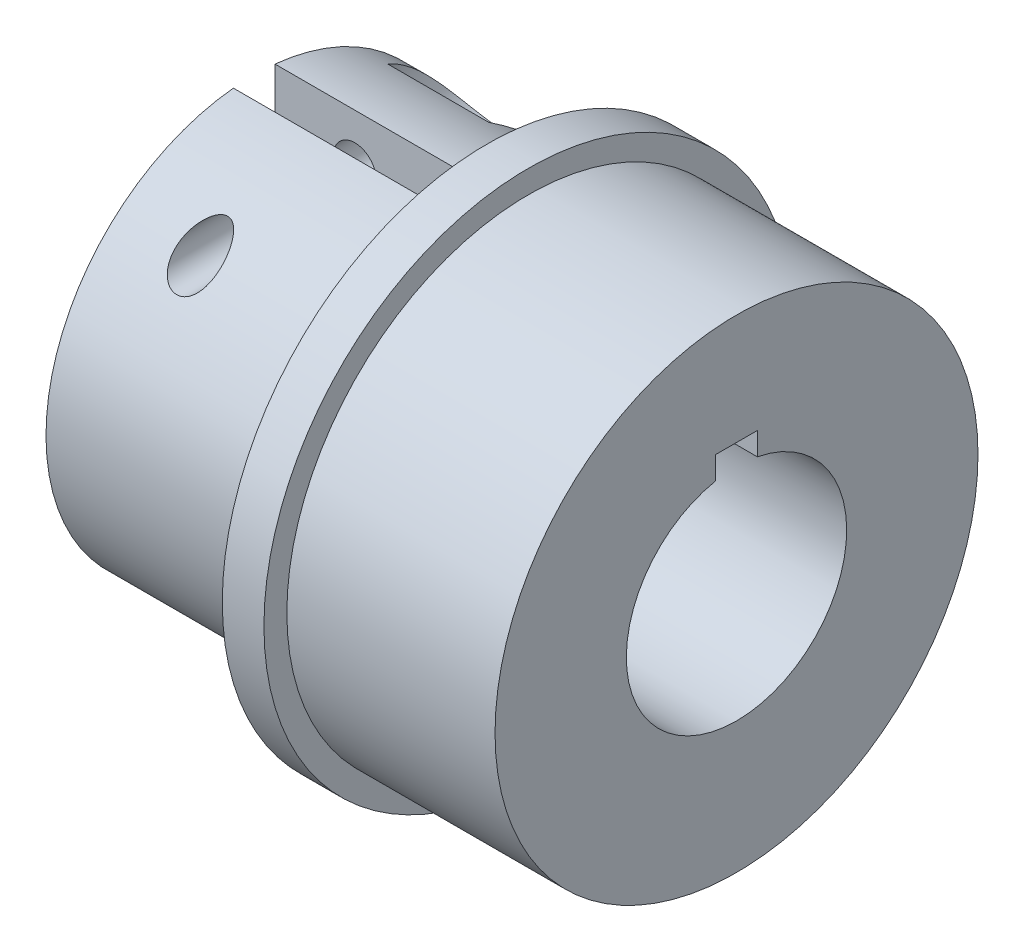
from build123d import *

# Parameters (mm, degrees)
SKETCH2_W               = 3
SKETCH2_H               = 3
CUT_EXTRUDE1_DEPTH      = 33.400694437
BOSS_EXTRUDE2_DEPTH     = 30
SKETCH7_W               = 3
SKETCH7_H               = 33.93511961
CUT_EXTRUDE3_DEPTH      = 30
CUT_EXTRUDE4_DEPTH      = 42.051248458
CUT_EXTRUDE4_DEPTH_BACK = 42.051248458
SKETCH8_R               = 1.533462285
CUT_EXTRUDE5_DEPTH      = 47.863685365
CUT_EXTRUDE5_DEPTH_BACK = 4
SKETCH9_R               = 4
CUT_EXTRUDE6_DEPTH      = 41.321272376
CUT_EXTRUDE6_DEPTH_BACK = 41.321272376
SKETCH10_W              = 15.409706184
SKETCH10_H              = 32.735213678


with BuildPart() as part:
    # Sketch1 → Revolve1 (revolve)
    with BuildSketch(Plane.XY, mode=Mode.PRIVATE) as revolve1_sk:
        Polygon((3, 19.05), (0, 19.05), (0, 7.9375), (18, 7.9375), (18, 17.399), (3, 17.399), align=None)
    revolve(revolve1_sk.sketch.rotate(Axis((0, 0, 0), (1, 0, 0)), 90), axis=Axis((0, 0, 0), (1, 0, 0)))

    # Sketch2 → Cut-Extrude1 (cut, through all)
    with BuildSketch(Plane(origin=(18, 0, 0), x_dir=(0, 0, -1), z_dir=(1, 0, 0))):
        with Locations((0, 7.9375)):
            Rectangle(SKETCH2_W, SKETCH2_H)
    extrude(amount=-CUT_EXTRUDE1_DEPTH, mode=Mode.SUBTRACT)

    # Sketch6 → Boss-Extrude2 (add)
    with BuildSketch(Plane.ZY):
        with BuildLine():
            Line((-1.5, 9.4375), (-1.5, 14.924811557))
            ThreePointArc((-1.5, 14.924811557), (-10.062305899, -11.124297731), (15, 0))
            ThreePointArc((15, 0), (11.124297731, 10.062305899), (1.5, 14.924811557))
            Line((1.5, 14.924811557), (1.5, 9.4375))
            Line((1.5, 9.4375), (1.5, 7.794479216))
            ThreePointArc((1.5, 7.794479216), (6.120055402, 5.054584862), (7.9375, 0))
            ThreePointArc((7.9375, 0), (-5.054584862, -6.120055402), (-1.5, 7.794479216))
            Line((-1.5, 7.794479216), (-1.5, 9.4375))
        make_face()
    extrude(amount=BOSS_EXTRUDE2_DEPTH)

    # Sketch7 → Cut-Extrude3 (cut)
    with BuildSketch(Plane.XY):
        with Locations((-1.5, 0)):
            Rectangle(SKETCH7_W, SKETCH7_H)
    extrude(amount=-CUT_EXTRUDE3_DEPTH, mode=Mode.SUBTRACT)

    # Sketch8 → Cut-Extrude4 (cut, two sides: drawn at the far end of the back side and taken through both)
    with BuildSketch(Plane.XY.offset(-1.5).offset(-CUT_EXTRUDE4_DEPTH_BACK)):
        with Locations((-22, 11.359645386)):
            Circle(SKETCH8_R)
        with Locations((-11, 11.359645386)):
            Circle(SKETCH8_R)
    extrude(amount=CUT_EXTRUDE4_DEPTH + CUT_EXTRUDE4_DEPTH_BACK, mode=Mode.SUBTRACT)

    # Sketch9 → Cut-Extrude5 (cut, two sides: drawn at the far end of the back side and taken through both)
    with BuildSketch(Plane(origin=(0, 0, -11.5), x_dir=(-1, 0, 0), z_dir=(0, 0, -1)).offset(-CUT_EXTRUDE5_DEPTH_BACK)):
        with Locations((11, 11.359645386)):
            Circle(SKETCH9_R)
        with Locations((22, 11.359645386)):
            Circle(SKETCH9_R)
    extrude(amount=CUT_EXTRUDE5_DEPTH + CUT_EXTRUDE5_DEPTH_BACK, mode=Mode.SUBTRACT)

    # Sketch10 → Cut-Extrude6 (cut, two sides: drawn at the far end of the back side and taken through both)
    with BuildSketch(Plane.XY.offset(-CUT_EXTRUDE6_DEPTH_BACK)):
        with Locations((-24.457139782, -0.91129191)):
            Rectangle(SKETCH10_W, SKETCH10_H)
    extrude(amount=CUT_EXTRUDE6_DEPTH + CUT_EXTRUDE6_DEPTH_BACK, mode=Mode.SUBTRACT)


solid = part.part
